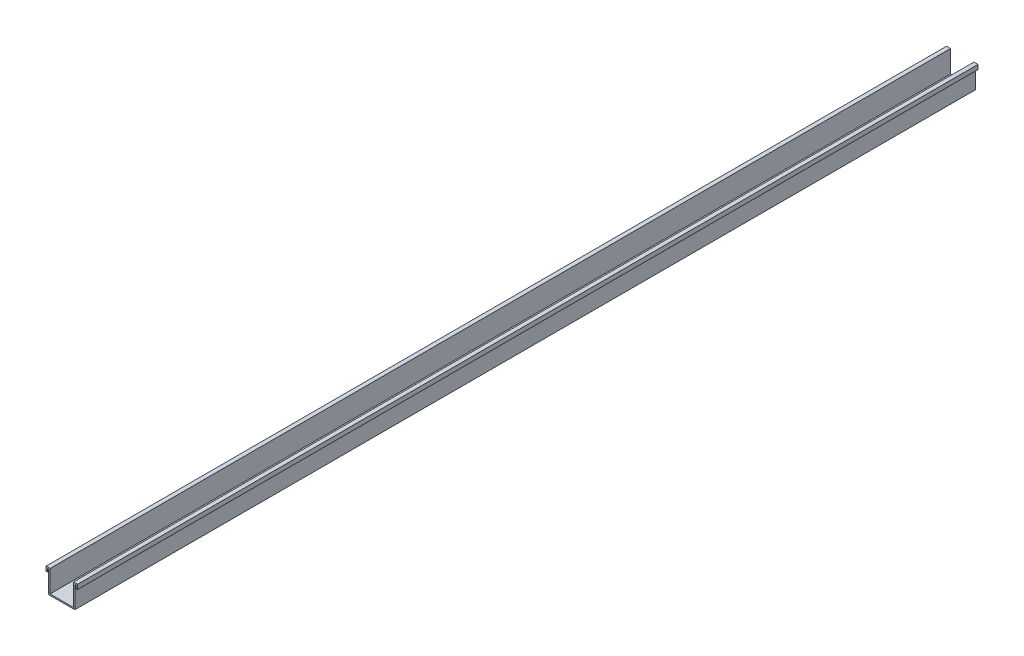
ISO-10303-21;
HEADER;
FILE_DESCRIPTION(('STEP AP214'),'2;1');
FILE_NAME('part.step','',(''),(''),'','','');
FILE_SCHEMA(('AUTOMOTIVE_DESIGN { 1 0 10303 214 1 1 1 1 }'));
ENDSEC;
DATA;
#1=APPLICATION_CONTEXT('core data for automotive mechanical design processes');
#2=APPLICATION_PROTOCOL_DEFINITION('international standard','automotive_design',2000,#1);
#3=PRODUCT_CONTEXT('',#1,'mechanical');
#4=PRODUCT('Part','Part','',(#3));
#5=PRODUCT_RELATED_PRODUCT_CATEGORY('part','',(#4));
#6=PRODUCT_DEFINITION_FORMATION('','',#4);
#7=PRODUCT_DEFINITION_CONTEXT('part definition',#1,'design');
#8=PRODUCT_DEFINITION('design','',#6,#7);
#9=PRODUCT_DEFINITION_SHAPE('','',#8);
#10=(LENGTH_UNIT() NAMED_UNIT(*) SI_UNIT(.MILLI.,.METRE.));
#11=(NAMED_UNIT(*) PLANE_ANGLE_UNIT() SI_UNIT($,.RADIAN.));
#12=(NAMED_UNIT(*) SI_UNIT($,.STERADIAN.) SOLID_ANGLE_UNIT());
#13=UNCERTAINTY_MEASURE_WITH_UNIT(LENGTH_MEASURE(1.E-05),#10,'distance_accuracy_value','');
#14=(GEOMETRIC_REPRESENTATION_CONTEXT(3) GLOBAL_UNCERTAINTY_ASSIGNED_CONTEXT((#13)) GLOBAL_UNIT_ASSIGNED_CONTEXT((#10,
#11,#12)) REPRESENTATION_CONTEXT('',''));
#15=CARTESIAN_POINT('',(0.,0.,0.));
#16=DIRECTION('',(0.,0.,1.));
#17=DIRECTION('',(1.,0.,0.));
#18=AXIS2_PLACEMENT_3D('',#15,#16,#17);
#19=CARTESIAN_POINT('',(-16.,24.5,1000.));
#20=DIRECTION('',(0.,1.,0.));
#21=DIRECTION('',(0.,0.,1.));
#22=AXIS2_PLACEMENT_3D('',#19,#20,#21);
#23=PLANE('',#22);
#24=DIRECTION('',(1.,0.,0.));
#25=VECTOR('',#24,1.);
#26=CARTESIAN_POINT('',(-16.,24.5,0.));
#27=LINE('',#26,#25);
#28=CARTESIAN_POINT('',(-16.,24.5,0.));
#29=VERTEX_POINT('',#28);
#30=CARTESIAN_POINT('',(-14.5,24.5,0.));
#31=VERTEX_POINT('',#30);
#32=EDGE_CURVE('E177',#29,#31,#27,.T.);
#33=ORIENTED_EDGE('',*,*,#32,.T.);
#34=DIRECTION('',(0.,0.,-1.));
#35=VECTOR('',#34,1.);
#36=CARTESIAN_POINT('',(-14.5,24.5,1000.));
#37=LINE('',#36,#35);
#38=CARTESIAN_POINT('',(-14.5,24.5,1000.));
#39=VERTEX_POINT('',#38);
#40=EDGE_CURVE('E11',#39,#31,#37,.T.);
#41=ORIENTED_EDGE('',*,*,#40,.F.);
#42=DIRECTION('',(1.,0.,0.));
#43=VECTOR('',#42,1.);
#44=CARTESIAN_POINT('',(-16.,24.5,1000.));
#45=LINE('',#44,#43);
#46=CARTESIAN_POINT('',(-16.,24.5,1000.));
#47=VERTEX_POINT('',#46);
#48=EDGE_CURVE('E207',#47,#39,#45,.T.);
#49=ORIENTED_EDGE('',*,*,#48,.F.);
#50=DIRECTION('',(0.,0.,-1.));
#51=VECTOR('',#50,1.);
#52=CARTESIAN_POINT('',(-16.,24.5,1000.));
#53=LINE('',#52,#51);
#54=EDGE_CURVE('E173',#47,#29,#53,.T.);
#55=ORIENTED_EDGE('',*,*,#54,.T.);
#56=EDGE_LOOP('',(#33,#41,#49,#55));
#57=FACE_BOUND('',#56,.T.);
#58=ADVANCED_FACE('F33',(#57),#23,.F.);
#59=CARTESIAN_POINT('',(-14.5,24.5,1000.));
#60=DIRECTION('',(1.,0.,0.));
#61=DIRECTION('',(0.,0.,-1.));
#62=AXIS2_PLACEMENT_3D('',#59,#60,#61);
#63=PLANE('',#62);
#64=DIRECTION('',(0.,-1.,0.));
#65=VECTOR('',#64,1.);
#66=CARTESIAN_POINT('',(-14.5,24.5,0.));
#67=LINE('',#66,#65);
#68=CARTESIAN_POINT('',(-14.5,0.,0.));
#69=VERTEX_POINT('',#68);
#70=EDGE_CURVE('E180',#31,#69,#67,.T.);
#71=ORIENTED_EDGE('',*,*,#70,.T.);
#72=DIRECTION('',(0.,0.,-1.));
#73=VECTOR('',#72,1.);
#74=CARTESIAN_POINT('',(-14.5,0.,1000.));
#75=LINE('',#74,#73);
#76=CARTESIAN_POINT('',(-14.5,0.,1000.));
#77=VERTEX_POINT('',#76);
#78=EDGE_CURVE('E41',#77,#69,#75,.T.);
#79=ORIENTED_EDGE('',*,*,#78,.F.);
#80=DIRECTION('',(0.,-1.,0.));
#81=VECTOR('',#80,1.);
#82=CARTESIAN_POINT('',(-14.5,24.5,1000.));
#83=LINE('',#82,#81);
#84=EDGE_CURVE('E116',#39,#77,#83,.T.);
#85=ORIENTED_EDGE('',*,*,#84,.F.);
#86=ORIENTED_EDGE('',*,*,#40,.T.);
#87=EDGE_LOOP('',(#71,#79,#85,#86));
#88=FACE_BOUND('',#87,.T.);
#89=ADVANCED_FACE('F305',(#88),#63,.F.);
#90=CARTESIAN_POINT('',(-14.5,0.,1000.));
#91=DIRECTION('',(0.,1.,0.));
#92=DIRECTION('',(0.,0.,1.));
#93=AXIS2_PLACEMENT_3D('',#90,#91,#92);
#94=PLANE('',#93);
#95=DIRECTION('',(1.,0.,0.));
#96=VECTOR('',#95,1.);
#97=CARTESIAN_POINT('',(-14.5,0.,0.));
#98=LINE('',#97,#96);
#99=CARTESIAN_POINT('',(14.5,0.,0.));
#100=VERTEX_POINT('',#99);
#101=EDGE_CURVE('E182',#69,#100,#98,.T.);
#102=ORIENTED_EDGE('',*,*,#101,.T.);
#103=DIRECTION('',(0.,0.,-1.));
#104=VECTOR('',#103,1.);
#105=CARTESIAN_POINT('',(14.5,0.,1000.));
#106=LINE('',#105,#104);
#107=CARTESIAN_POINT('',(14.5,0.,1000.));
#108=VERTEX_POINT('',#107);
#109=EDGE_CURVE('E238',#108,#100,#106,.T.);
#110=ORIENTED_EDGE('',*,*,#109,.F.);
#111=DIRECTION('',(1.,0.,0.));
#112=VECTOR('',#111,1.);
#113=CARTESIAN_POINT('',(-14.5,0.,1000.));
#114=LINE('',#113,#112);
#115=EDGE_CURVE('E246',#77,#108,#114,.T.);
#116=ORIENTED_EDGE('',*,*,#115,.F.);
#117=ORIENTED_EDGE('',*,*,#78,.T.);
#118=EDGE_LOOP('',(#102,#110,#116,#117));
#119=FACE_BOUND('',#118,.T.);
#120=ADVANCED_FACE('F244',(#119),#94,.F.);
#121=CARTESIAN_POINT('',(14.5,0.,1000.));
#122=DIRECTION('',(-1.,0.,0.));
#123=DIRECTION('',(0.,0.,1.));
#124=AXIS2_PLACEMENT_3D('',#121,#122,#123);
#125=PLANE('',#124);
#126=DIRECTION('',(0.,1.,0.));
#127=VECTOR('',#126,1.);
#128=CARTESIAN_POINT('',(14.5,0.,0.));
#129=LINE('',#128,#127);
#130=CARTESIAN_POINT('',(14.5,24.5,0.));
#131=VERTEX_POINT('',#130);
#132=EDGE_CURVE('E184',#100,#131,#129,.T.);
#133=ORIENTED_EDGE('',*,*,#132,.T.);
#134=DIRECTION('',(0.,0.,-1.));
#135=VECTOR('',#134,1.);
#136=CARTESIAN_POINT('',(14.5,24.5,1000.));
#137=LINE('',#136,#135);
#138=CARTESIAN_POINT('',(14.5,24.5,1000.));
#139=VERTEX_POINT('',#138);
#140=EDGE_CURVE('E235',#139,#131,#137,.T.);
#141=ORIENTED_EDGE('',*,*,#140,.F.);
#142=DIRECTION('',(0.,1.,0.));
#143=VECTOR('',#142,1.);
#144=CARTESIAN_POINT('',(14.5,0.,1000.));
#145=LINE('',#144,#143);
#146=EDGE_CURVE('E264',#108,#139,#145,.T.);
#147=ORIENTED_EDGE('',*,*,#146,.F.);
#148=ORIENTED_EDGE('',*,*,#109,.T.);
#149=EDGE_LOOP('',(#133,#141,#147,#148));
#150=FACE_BOUND('',#149,.T.);
#151=ADVANCED_FACE('F255',(#150),#125,.F.);
#152=CARTESIAN_POINT('',(14.5,24.5,1000.));
#153=DIRECTION('',(0.,1.,0.));
#154=DIRECTION('',(0.,0.,1.));
#155=AXIS2_PLACEMENT_3D('',#152,#153,#154);
#156=PLANE('',#155);
#157=DIRECTION('',(1.,0.,0.));
#158=VECTOR('',#157,1.);
#159=CARTESIAN_POINT('',(14.5,24.5,0.));
#160=LINE('',#159,#158);
#161=CARTESIAN_POINT('',(16.,24.5,0.));
#162=VERTEX_POINT('',#161);
#163=EDGE_CURVE('E186',#131,#162,#160,.T.);
#164=ORIENTED_EDGE('',*,*,#163,.T.);
#165=DIRECTION('',(0.,0.,-1.));
#166=VECTOR('',#165,1.);
#167=CARTESIAN_POINT('',(16.,24.5,1000.));
#168=LINE('',#167,#166);
#169=CARTESIAN_POINT('',(16.,24.5,1000.));
#170=VERTEX_POINT('',#169);
#171=EDGE_CURVE('E232',#170,#162,#168,.T.);
#172=ORIENTED_EDGE('',*,*,#171,.F.);
#173=DIRECTION('',(1.,0.,0.));
#174=VECTOR('',#173,1.);
#175=CARTESIAN_POINT('',(14.5,24.5,1000.));
#176=LINE('',#175,#174);
#177=EDGE_CURVE('E261',#139,#170,#176,.T.);
#178=ORIENTED_EDGE('',*,*,#177,.F.);
#179=ORIENTED_EDGE('',*,*,#140,.T.);
#180=EDGE_LOOP('',(#164,#172,#178,#179));
#181=FACE_BOUND('',#180,.T.);
#182=ADVANCED_FACE('F259',(#181),#156,.F.);
#183=CARTESIAN_POINT('',(16.,24.5,1000.));
#184=DIRECTION('',(1.,0.,0.));
#185=DIRECTION('',(0.,0.,-1.));
#186=AXIS2_PLACEMENT_3D('',#183,#184,#185);
#187=PLANE('',#186);
#188=DIRECTION('',(0.,-1.,0.));
#189=VECTOR('',#188,1.);
#190=CARTESIAN_POINT('',(16.,24.5,0.));
#191=LINE('',#190,#189);
#192=CARTESIAN_POINT('',(16.,21.,0.));
#193=VERTEX_POINT('',#192);
#194=EDGE_CURVE('E188',#162,#193,#191,.T.);
#195=ORIENTED_EDGE('',*,*,#194,.T.);
#196=DIRECTION('',(0.,0.,-1.));
#197=VECTOR('',#196,1.);
#198=CARTESIAN_POINT('',(16.,21.,1000.));
#199=LINE('',#198,#197);
#200=CARTESIAN_POINT('',(16.,21.,1000.));
#201=VERTEX_POINT('',#200);
#202=EDGE_CURVE('E229',#201,#193,#199,.T.);
#203=ORIENTED_EDGE('',*,*,#202,.F.);
#204=DIRECTION('',(0.,-1.,0.));
#205=VECTOR('',#204,1.);
#206=CARTESIAN_POINT('',(16.,24.5,1000.));
#207=LINE('',#206,#205);
#208=EDGE_CURVE('E263',#170,#201,#207,.T.);
#209=ORIENTED_EDGE('',*,*,#208,.F.);
#210=ORIENTED_EDGE('',*,*,#171,.T.);
#211=EDGE_LOOP('',(#195,#203,#209,#210));
#212=FACE_BOUND('',#211,.T.);
#213=ADVANCED_FACE('F318',(#212),#187,.F.);
#214=CARTESIAN_POINT('',(16.,21.,1000.));
#215=DIRECTION('',(0.,1.,0.));
#216=DIRECTION('',(0.,0.,1.));
#217=AXIS2_PLACEMENT_3D('',#214,#215,#216);
#218=PLANE('',#217);
#219=DIRECTION('',(1.,0.,0.));
#220=VECTOR('',#219,1.);
#221=CARTESIAN_POINT('',(16.,21.,0.));
#222=LINE('',#221,#220);
#223=CARTESIAN_POINT('',(17.5,21.,0.));
#224=VERTEX_POINT('',#223);
#225=EDGE_CURVE('E190',#193,#224,#222,.T.);
#226=ORIENTED_EDGE('',*,*,#225,.T.);
#227=DIRECTION('',(0.,0.,-1.));
#228=VECTOR('',#227,1.);
#229=CARTESIAN_POINT('',(17.5,21.,1000.));
#230=LINE('',#229,#228);
#231=CARTESIAN_POINT('',(17.5,21.,1000.));
#232=VERTEX_POINT('',#231);
#233=EDGE_CURVE('E226',#232,#224,#230,.T.);
#234=ORIENTED_EDGE('',*,*,#233,.F.);
#235=DIRECTION('',(1.,0.,0.));
#236=VECTOR('',#235,1.);
#237=CARTESIAN_POINT('',(16.,21.,1000.));
#238=LINE('',#237,#236);
#239=EDGE_CURVE('E266',#201,#232,#238,.T.);
#240=ORIENTED_EDGE('',*,*,#239,.F.);
#241=ORIENTED_EDGE('',*,*,#202,.T.);
#242=EDGE_LOOP('',(#226,#234,#240,#241));
#243=FACE_BOUND('',#242,.T.);
#244=ADVANCED_FACE('F321',(#243),#218,.F.);
#245=CARTESIAN_POINT('',(17.5,21.,1000.));
#246=DIRECTION('',(-1.,0.,0.));
#247=DIRECTION('',(0.,0.,1.));
#248=AXIS2_PLACEMENT_3D('',#245,#246,#247);
#249=PLANE('',#248);
#250=DIRECTION('',(0.,1.,0.));
#251=VECTOR('',#250,1.);
#252=CARTESIAN_POINT('',(17.5,21.,0.));
#253=LINE('',#252,#251);
#254=CARTESIAN_POINT('',(17.5,26.,0.));
#255=VERTEX_POINT('',#254);
#256=EDGE_CURVE('E192',#224,#255,#253,.T.);
#257=ORIENTED_EDGE('',*,*,#256,.T.);
#258=DIRECTION('',(0.,0.,-1.));
#259=VECTOR('',#258,1.);
#260=CARTESIAN_POINT('',(17.5,26.,1000.));
#261=LINE('',#260,#259);
#262=CARTESIAN_POINT('',(17.5,26.,1000.));
#263=VERTEX_POINT('',#262);
#264=EDGE_CURVE('E223',#263,#255,#261,.T.);
#265=ORIENTED_EDGE('',*,*,#264,.F.);
#266=DIRECTION('',(0.,1.,0.));
#267=VECTOR('',#266,1.);
#268=CARTESIAN_POINT('',(17.5,21.,1000.));
#269=LINE('',#268,#267);
#270=EDGE_CURVE('E272',#232,#263,#269,.T.);
#271=ORIENTED_EDGE('',*,*,#270,.F.);
#272=ORIENTED_EDGE('',*,*,#233,.T.);
#273=EDGE_LOOP('',(#257,#265,#271,#272));
#274=FACE_BOUND('',#273,.T.);
#275=ADVANCED_FACE('F325',(#274),#249,.F.);
#276=CARTESIAN_POINT('',(17.5,26.,1000.));
#277=DIRECTION('',(0.,-1.,0.));
#278=DIRECTION('',(0.,0.,-1.));
#279=AXIS2_PLACEMENT_3D('',#276,#277,#278);
#280=PLANE('',#279);
#281=DIRECTION('',(-1.,0.,0.));
#282=VECTOR('',#281,1.);
#283=CARTESIAN_POINT('',(17.5,26.,0.));
#284=LINE('',#283,#282);
#285=CARTESIAN_POINT('',(13.,26.,0.));
#286=VERTEX_POINT('',#285);
#287=EDGE_CURVE('E194',#255,#286,#284,.T.);
#288=ORIENTED_EDGE('',*,*,#287,.T.);
#289=DIRECTION('',(0.,0.,-1.));
#290=VECTOR('',#289,1.);
#291=CARTESIAN_POINT('',(13.,26.,1000.));
#292=LINE('',#291,#290);
#293=CARTESIAN_POINT('',(13.,26.,1000.));
#294=VERTEX_POINT('',#293);
#295=EDGE_CURVE('E220',#294,#286,#292,.T.);
#296=ORIENTED_EDGE('',*,*,#295,.F.);
#297=DIRECTION('',(-1.,0.,0.));
#298=VECTOR('',#297,1.);
#299=CARTESIAN_POINT('',(17.5,26.,1000.));
#300=LINE('',#299,#298);
#301=EDGE_CURVE('E274',#263,#294,#300,.T.);
#302=ORIENTED_EDGE('',*,*,#301,.F.);
#303=ORIENTED_EDGE('',*,*,#264,.T.);
#304=EDGE_LOOP('',(#288,#296,#302,#303));
#305=FACE_BOUND('',#304,.T.);
#306=ADVANCED_FACE('F329',(#305),#280,.F.);
#307=CARTESIAN_POINT('',(13.,26.,1000.));
#308=DIRECTION('',(1.,0.,0.));
#309=DIRECTION('',(0.,0.,-1.));
#310=AXIS2_PLACEMENT_3D('',#307,#308,#309);
#311=PLANE('',#310);
#312=DIRECTION('',(0.,-1.,0.));
#313=VECTOR('',#312,1.);
#314=CARTESIAN_POINT('',(13.,26.,0.));
#315=LINE('',#314,#313);
#316=CARTESIAN_POINT('',(13.,1.5,0.));
#317=VERTEX_POINT('',#316);
#318=EDGE_CURVE('E196',#286,#317,#315,.T.);
#319=ORIENTED_EDGE('',*,*,#318,.T.);
#320=DIRECTION('',(0.,0.,-1.));
#321=VECTOR('',#320,1.);
#322=CARTESIAN_POINT('',(13.,1.5,1000.));
#323=LINE('',#322,#321);
#324=CARTESIAN_POINT('',(13.,1.5,1000.));
#325=VERTEX_POINT('',#324);
#326=EDGE_CURVE('E217',#325,#317,#323,.T.);
#327=ORIENTED_EDGE('',*,*,#326,.F.);
#328=DIRECTION('',(0.,-1.,0.));
#329=VECTOR('',#328,1.);
#330=CARTESIAN_POINT('',(13.,26.,1000.));
#331=LINE('',#330,#329);
#332=EDGE_CURVE('E276',#294,#325,#331,.T.);
#333=ORIENTED_EDGE('',*,*,#332,.F.);
#334=ORIENTED_EDGE('',*,*,#295,.T.);
#335=EDGE_LOOP('',(#319,#327,#333,#334));
#336=FACE_BOUND('',#335,.T.);
#337=ADVANCED_FACE('F333',(#336),#311,.F.);
#338=CARTESIAN_POINT('',(13.,1.5,1000.));
#339=DIRECTION('',(0.,-1.,0.));
#340=DIRECTION('',(0.,0.,-1.));
#341=AXIS2_PLACEMENT_3D('',#338,#339,#340);
#342=PLANE('',#341);
#343=DIRECTION('',(-1.,0.,0.));
#344=VECTOR('',#343,1.);
#345=CARTESIAN_POINT('',(13.,1.5,0.));
#346=LINE('',#345,#344);
#347=CARTESIAN_POINT('',(-13.,1.5,0.));
#348=VERTEX_POINT('',#347);
#349=EDGE_CURVE('E198',#317,#348,#346,.T.);
#350=ORIENTED_EDGE('',*,*,#349,.T.);
#351=DIRECTION('',(0.,0.,-1.));
#352=VECTOR('',#351,1.);
#353=CARTESIAN_POINT('',(-13.,1.5,1000.));
#354=LINE('',#353,#352);
#355=CARTESIAN_POINT('',(-13.,1.5,1000.));
#356=VERTEX_POINT('',#355);
#357=EDGE_CURVE('E214',#356,#348,#354,.T.);
#358=ORIENTED_EDGE('',*,*,#357,.F.);
#359=DIRECTION('',(-1.,0.,0.));
#360=VECTOR('',#359,1.);
#361=CARTESIAN_POINT('',(13.,1.5,1000.));
#362=LINE('',#361,#360);
#363=EDGE_CURVE('E278',#325,#356,#362,.T.);
#364=ORIENTED_EDGE('',*,*,#363,.F.);
#365=ORIENTED_EDGE('',*,*,#326,.T.);
#366=EDGE_LOOP('',(#350,#358,#364,#365));
#367=FACE_BOUND('',#366,.T.);
#368=ADVANCED_FACE('F337',(#367),#342,.F.);
#369=CARTESIAN_POINT('',(-13.,1.5,1000.));
#370=DIRECTION('',(-1.,0.,0.));
#371=DIRECTION('',(0.,0.,1.));
#372=AXIS2_PLACEMENT_3D('',#369,#370,#371);
#373=PLANE('',#372);
#374=DIRECTION('',(0.,1.,0.));
#375=VECTOR('',#374,1.);
#376=CARTESIAN_POINT('',(-13.,1.5,0.));
#377=LINE('',#376,#375);
#378=CARTESIAN_POINT('',(-13.,26.,0.));
#379=VERTEX_POINT('',#378);
#380=EDGE_CURVE('E200',#348,#379,#377,.T.);
#381=ORIENTED_EDGE('',*,*,#380,.T.);
#382=DIRECTION('',(0.,0.,-1.));
#383=VECTOR('',#382,1.);
#384=CARTESIAN_POINT('',(-13.,26.,1000.));
#385=LINE('',#384,#383);
#386=CARTESIAN_POINT('',(-13.,26.,1000.));
#387=VERTEX_POINT('',#386);
#388=EDGE_CURVE('E211',#387,#379,#385,.T.);
#389=ORIENTED_EDGE('',*,*,#388,.F.);
#390=DIRECTION('',(0.,1.,0.));
#391=VECTOR('',#390,1.);
#392=CARTESIAN_POINT('',(-13.,1.5,1000.));
#393=LINE('',#392,#391);
#394=EDGE_CURVE('E280',#356,#387,#393,.T.);
#395=ORIENTED_EDGE('',*,*,#394,.F.);
#396=ORIENTED_EDGE('',*,*,#357,.T.);
#397=EDGE_LOOP('',(#381,#389,#395,#396));
#398=FACE_BOUND('',#397,.T.);
#399=ADVANCED_FACE('F286',(#398),#373,.F.);
#400=CARTESIAN_POINT('',(-13.,26.,1000.));
#401=DIRECTION('',(0.,-1.,0.));
#402=DIRECTION('',(0.,0.,-1.));
#403=AXIS2_PLACEMENT_3D('',#400,#401,#402);
#404=PLANE('',#403);
#405=DIRECTION('',(-1.,0.,0.));
#406=VECTOR('',#405,1.);
#407=CARTESIAN_POINT('',(-13.,26.,0.));
#408=LINE('',#407,#406);
#409=CARTESIAN_POINT('',(-17.5,26.,0.));
#410=VERTEX_POINT('',#409);
#411=EDGE_CURVE('E202',#379,#410,#408,.T.);
#412=ORIENTED_EDGE('',*,*,#411,.T.);
#413=DIRECTION('',(0.,0.,-1.));
#414=VECTOR('',#413,1.);
#415=CARTESIAN_POINT('',(-17.5,26.,1000.));
#416=LINE('',#415,#414);
#417=CARTESIAN_POINT('',(-17.5,26.,1000.));
#418=VERTEX_POINT('',#417);
#419=EDGE_CURVE('E168',#418,#410,#416,.T.);
#420=ORIENTED_EDGE('',*,*,#419,.F.);
#421=DIRECTION('',(-1.,0.,0.));
#422=VECTOR('',#421,1.);
#423=CARTESIAN_POINT('',(-13.,26.,1000.));
#424=LINE('',#423,#422);
#425=EDGE_CURVE('E159',#387,#418,#424,.T.);
#426=ORIENTED_EDGE('',*,*,#425,.F.);
#427=ORIENTED_EDGE('',*,*,#388,.T.);
#428=EDGE_LOOP('',(#412,#420,#426,#427));
#429=FACE_BOUND('',#428,.T.);
#430=ADVANCED_FACE('F290',(#429),#404,.F.);
#431=CARTESIAN_POINT('',(-17.5,26.,1000.));
#432=DIRECTION('',(1.,0.,0.));
#433=DIRECTION('',(0.,0.,-1.));
#434=AXIS2_PLACEMENT_3D('',#431,#432,#433);
#435=PLANE('',#434);
#436=DIRECTION('',(0.,-1.,0.));
#437=VECTOR('',#436,1.);
#438=CARTESIAN_POINT('',(-17.5,26.,0.));
#439=LINE('',#438,#437);
#440=CARTESIAN_POINT('',(-17.5,21.,0.));
#441=VERTEX_POINT('',#440);
#442=EDGE_CURVE('E167',#410,#441,#439,.T.);
#443=ORIENTED_EDGE('',*,*,#442,.T.);
#444=DIRECTION('',(0.,0.,-1.));
#445=VECTOR('',#444,1.);
#446=CARTESIAN_POINT('',(-17.5,21.,1000.));
#447=LINE('',#446,#445);
#448=CARTESIAN_POINT('',(-17.5,21.,1000.));
#449=VERTEX_POINT('',#448);
#450=EDGE_CURVE('E164',#449,#441,#447,.T.);
#451=ORIENTED_EDGE('',*,*,#450,.F.);
#452=DIRECTION('',(0.,-1.,0.));
#453=VECTOR('',#452,1.);
#454=CARTESIAN_POINT('',(-17.5,26.,1000.));
#455=LINE('',#454,#453);
#456=EDGE_CURVE('E153',#418,#449,#455,.T.);
#457=ORIENTED_EDGE('',*,*,#456,.F.);
#458=ORIENTED_EDGE('',*,*,#419,.T.);
#459=EDGE_LOOP('',(#443,#451,#457,#458));
#460=FACE_BOUND('',#459,.T.);
#461=ADVANCED_FACE('F165',(#460),#435,.F.);
#462=CARTESIAN_POINT('',(-17.5,21.,1000.));
#463=DIRECTION('',(0.,1.,0.));
#464=DIRECTION('',(0.,0.,1.));
#465=AXIS2_PLACEMENT_3D('',#462,#463,#464);
#466=PLANE('',#465);
#467=DIRECTION('',(1.,0.,0.));
#468=VECTOR('',#467,1.);
#469=CARTESIAN_POINT('',(-17.5,21.,0.));
#470=LINE('',#469,#468);
#471=CARTESIAN_POINT('',(-16.,21.,0.));
#472=VERTEX_POINT('',#471);
#473=EDGE_CURVE('E102',#441,#472,#470,.T.);
#474=ORIENTED_EDGE('',*,*,#473,.T.);
#475=DIRECTION('',(0.,0.,-1.));
#476=VECTOR('',#475,1.);
#477=CARTESIAN_POINT('',(-16.,21.,1000.));
#478=LINE('',#477,#476);
#479=CARTESIAN_POINT('',(-16.,21.,1000.));
#480=VERTEX_POINT('',#479);
#481=EDGE_CURVE('E169',#480,#472,#478,.T.);
#482=ORIENTED_EDGE('',*,*,#481,.F.);
#483=DIRECTION('',(1.,0.,0.));
#484=VECTOR('',#483,1.);
#485=CARTESIAN_POINT('',(-17.5,21.,1000.));
#486=LINE('',#485,#484);
#487=EDGE_CURVE('E157',#449,#480,#486,.T.);
#488=ORIENTED_EDGE('',*,*,#487,.F.);
#489=ORIENTED_EDGE('',*,*,#450,.T.);
#490=EDGE_LOOP('',(#474,#482,#488,#489));
#491=FACE_BOUND('',#490,.T.);
#492=ADVANCED_FACE('F171',(#491),#466,.F.);
#493=CARTESIAN_POINT('',(-16.,21.,1000.));
#494=DIRECTION('',(-1.,0.,0.));
#495=DIRECTION('',(0.,0.,1.));
#496=AXIS2_PLACEMENT_3D('',#493,#494,#495);
#497=PLANE('',#496);
#498=DIRECTION('',(0.,1.,0.));
#499=VECTOR('',#498,1.);
#500=CARTESIAN_POINT('',(-16.,21.,0.));
#501=LINE('',#500,#499);
#502=EDGE_CURVE('E108',#472,#29,#501,.T.);
#503=ORIENTED_EDGE('',*,*,#502,.T.);
#504=ORIENTED_EDGE('',*,*,#54,.F.);
#505=DIRECTION('',(0.,1.,0.));
#506=VECTOR('',#505,1.);
#507=CARTESIAN_POINT('',(-16.,21.,1000.));
#508=LINE('',#507,#506);
#509=EDGE_CURVE('E49',#480,#47,#508,.T.);
#510=ORIENTED_EDGE('',*,*,#509,.F.);
#511=ORIENTED_EDGE('',*,*,#481,.T.);
#512=EDGE_LOOP('',(#503,#504,#510,#511));
#513=FACE_BOUND('',#512,.T.);
#514=ADVANCED_FACE('F294',(#513),#497,.F.);
#515=CARTESIAN_POINT('',(0.,0.,1000.));
#516=DIRECTION('',(0.,0.,-1.));
#517=DIRECTION('',(-1.,0.,0.));
#518=AXIS2_PLACEMENT_3D('',#515,#516,#517);
#519=PLANE('',#518);
#520=ORIENTED_EDGE('',*,*,#48,.T.);
#521=ORIENTED_EDGE('',*,*,#84,.T.);
#522=ORIENTED_EDGE('',*,*,#115,.T.);
#523=ORIENTED_EDGE('',*,*,#146,.T.);
#524=ORIENTED_EDGE('',*,*,#177,.T.);
#525=ORIENTED_EDGE('',*,*,#208,.T.);
#526=ORIENTED_EDGE('',*,*,#239,.T.);
#527=ORIENTED_EDGE('',*,*,#270,.T.);
#528=ORIENTED_EDGE('',*,*,#301,.T.);
#529=ORIENTED_EDGE('',*,*,#332,.T.);
#530=ORIENTED_EDGE('',*,*,#363,.T.);
#531=ORIENTED_EDGE('',*,*,#394,.T.);
#532=ORIENTED_EDGE('',*,*,#425,.T.);
#533=ORIENTED_EDGE('',*,*,#456,.T.);
#534=ORIENTED_EDGE('',*,*,#487,.T.);
#535=ORIENTED_EDGE('',*,*,#509,.T.);
#536=EDGE_LOOP('',(#520,#521,#522,#523,#524,#525,#526,#527,#528,#529,#530,#531,#532,#533,#534,#535));
#537=FACE_BOUND('',#536,.T.);
#538=ADVANCED_FACE('F155',(#537),#519,.F.);
#539=CARTESIAN_POINT('',(0.,0.,0.));
#540=DIRECTION('',(0.,0.,-1.));
#541=DIRECTION('',(-1.,0.,0.));
#542=AXIS2_PLACEMENT_3D('',#539,#540,#541);
#543=PLANE('',#542);
#544=ORIENTED_EDGE('',*,*,#32,.F.);
#545=ORIENTED_EDGE('',*,*,#502,.F.);
#546=ORIENTED_EDGE('',*,*,#473,.F.);
#547=ORIENTED_EDGE('',*,*,#442,.F.);
#548=ORIENTED_EDGE('',*,*,#411,.F.);
#549=ORIENTED_EDGE('',*,*,#380,.F.);
#550=ORIENTED_EDGE('',*,*,#349,.F.);
#551=ORIENTED_EDGE('',*,*,#318,.F.);
#552=ORIENTED_EDGE('',*,*,#287,.F.);
#553=ORIENTED_EDGE('',*,*,#256,.F.);
#554=ORIENTED_EDGE('',*,*,#225,.F.);
#555=ORIENTED_EDGE('',*,*,#194,.F.);
#556=ORIENTED_EDGE('',*,*,#163,.F.);
#557=ORIENTED_EDGE('',*,*,#132,.F.);
#558=ORIENTED_EDGE('',*,*,#101,.F.);
#559=ORIENTED_EDGE('',*,*,#70,.F.);
#560=EDGE_LOOP('',(#544,#545,#546,#547,#548,#549,#550,#551,#552,#553,#554,#555,#556,#557,#558,#559));
#561=FACE_BOUND('',#560,.T.);
#562=ADVANCED_FACE('F250',(#561),#543,.T.);
#563=CLOSED_SHELL('',(#58,#89,#120,#151,#182,#213,#244,#275,#306,#337,#368,#399,#430,#461,#492,
#514,#538,#562));
#564=MANIFOLD_SOLID_BREP('B2',#563);
#565=ADVANCED_BREP_SHAPE_REPRESENTATION('',(#18,#564),#14);
#566=SHAPE_DEFINITION_REPRESENTATION(#9,#565);
ENDSEC;
END-ISO-10303-21;
